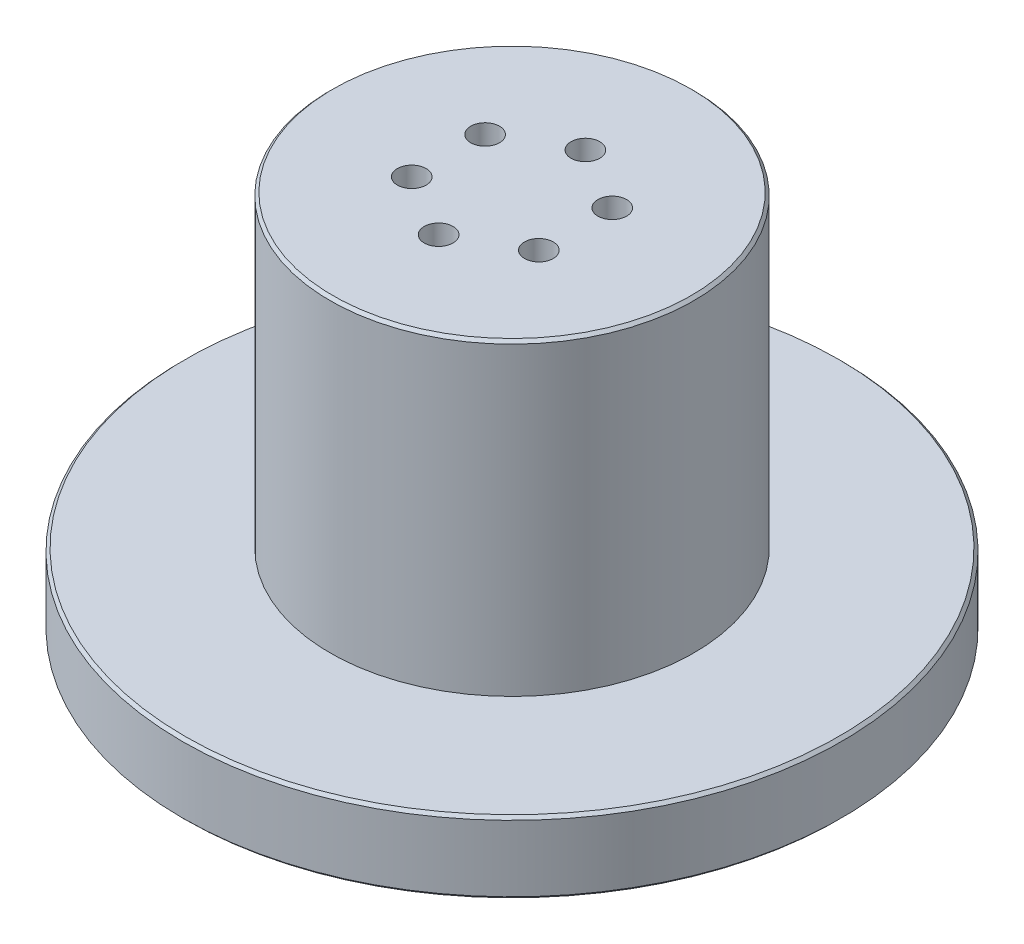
from build123d import *

# Parameters (mm, degrees)
R_P_TITION_CIRCULAIRE1_COUNT = 6
CHANFREIN1_SIZE              = 0.5


with BuildPart() as part:
    # Esquisse1 → R_volution1 (revolve)
    with BuildSketch(Plane.XY, mode=Mode.PRIVATE) as r_volution1_sk:
        Polygon((0, 0), (-57.25, 0), (-57.25, 12.5), (-31.6, 12.5), (-31.6, 66), (0, 66), align=None)
    revolve(r_volution1_sk.sketch.rotate(Axis((0, -37.466886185, 0), (0, 1, 0)), 270), axis=Axis((0, -37.466886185, 0), (0, 1, 0)))

    # Esquisse2 → Trou taraud_ M61 (revolve, cut)
    with BuildSketch(Plane(origin=(0, 66, 12.75), x_dir=(0, 0, 1), z_dir=(1, 0, 0))):
        Polygon((0, 0), (0, 18.502151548), (2.5, 17), (2.5, 0), align=None)
    trou_taraud_m61 = revolve(axis=Axis((0, 72.35, 12.75), (0, -1, 0)), mode=Mode.SUBTRACT)

    # R_p_tition circulaire1: Trou taraud_ M61 ×6 about axis
    r_p_tition_circulaire1_axis = Axis((0, 0, 0), (0, 1, 0))
    for i in range(1, R_P_TITION_CIRCULAIRE1_COUNT):
        add(trou_taraud_m61.rotate(r_p_tition_circulaire1_axis, i * 360 / R_P_TITION_CIRCULAIRE1_COUNT), mode=Mode.SUBTRACT)

    # Chanfrein1
    chanfrein1_edges = [part.edges().sort_by_distance(p)[0] for p in [
        (0, 66, 31.6),
        (0, 12.5, 57.25),
        (0, 0, 57.25),
    ]]
    chamfer(chanfrein1_edges, length=CHANFREIN1_SIZE)


solid = part.part
